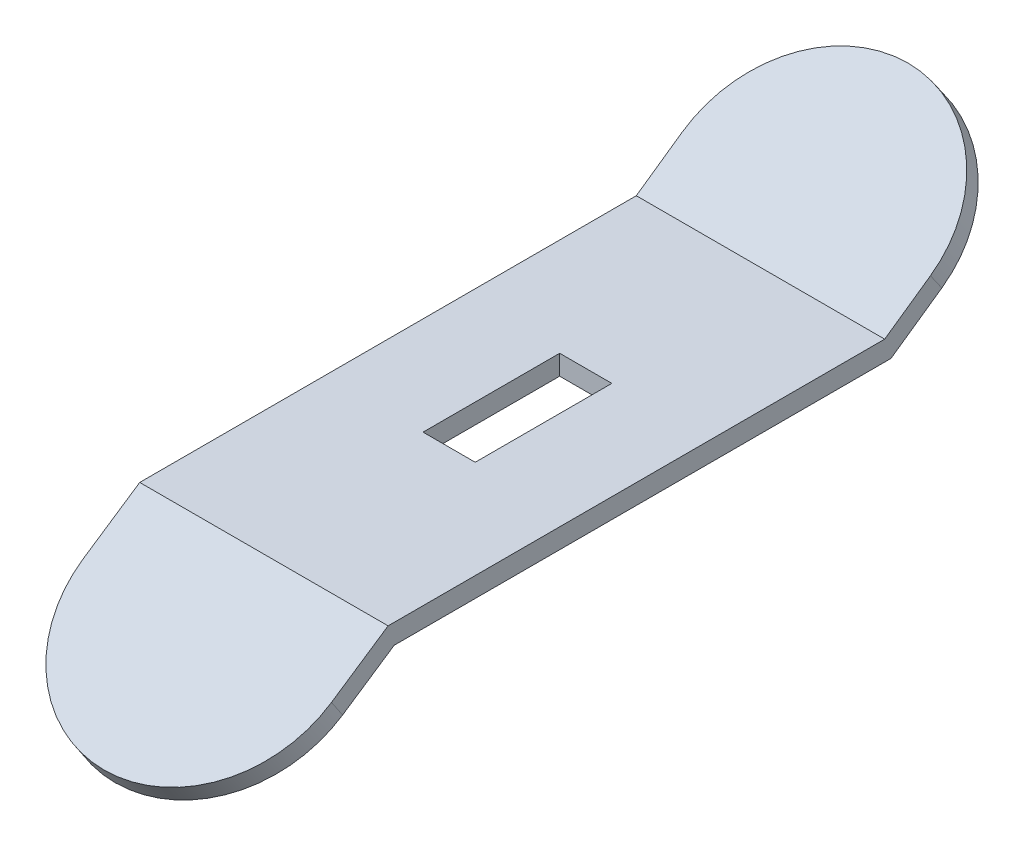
ISO-10303-21;
HEADER;
FILE_DESCRIPTION(('STEP AP214'),'2;1');
FILE_NAME('part.step','',(''),(''),'','','');
FILE_SCHEMA(('AUTOMOTIVE_DESIGN { 1 0 10303 214 1 1 1 1 }'));
ENDSEC;
DATA;
#1=APPLICATION_CONTEXT('core data for automotive mechanical design processes');
#2=APPLICATION_PROTOCOL_DEFINITION('international standard','automotive_design',2000,#1);
#3=PRODUCT_CONTEXT('',#1,'mechanical');
#4=PRODUCT('Part','Part','',(#3));
#5=PRODUCT_RELATED_PRODUCT_CATEGORY('part','',(#4));
#6=PRODUCT_DEFINITION_FORMATION('','',#4);
#7=PRODUCT_DEFINITION_CONTEXT('part definition',#1,'design');
#8=PRODUCT_DEFINITION('design','',#6,#7);
#9=PRODUCT_DEFINITION_SHAPE('','',#8);
#10=(LENGTH_UNIT() NAMED_UNIT(*) SI_UNIT(.MILLI.,.METRE.));
#11=(NAMED_UNIT(*) PLANE_ANGLE_UNIT() SI_UNIT($,.RADIAN.));
#12=(NAMED_UNIT(*) SI_UNIT($,.STERADIAN.) SOLID_ANGLE_UNIT());
#13=UNCERTAINTY_MEASURE_WITH_UNIT(LENGTH_MEASURE(1.E-05),#10,'distance_accuracy_value','');
#14=(GEOMETRIC_REPRESENTATION_CONTEXT(3) GLOBAL_UNCERTAINTY_ASSIGNED_CONTEXT((#13)) GLOBAL_UNIT_ASSIGNED_CONTEXT((#10,
#11,#12)) REPRESENTATION_CONTEXT('',''));
#15=CARTESIAN_POINT('',(0.,0.,0.));
#16=DIRECTION('',(0.,0.,1.));
#17=DIRECTION('',(1.,0.,0.));
#18=AXIS2_PLACEMENT_3D('',#15,#16,#17);
#19=CARTESIAN_POINT('',(0.,4.17852545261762,-23.2511802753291));
#20=DIRECTION('',(0.,-0.819152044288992,-0.573576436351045));
#21=DIRECTION('',(0.,0.573576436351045,-0.819152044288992));
#22=AXIS2_PLACEMENT_3D('',#19,#20,#21);
#23=CYLINDRICAL_SURFACE('',#22,10.);
#24=DIRECTION('',(0.,-0.819152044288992,-0.573576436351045));
#25=VECTOR('',#24,1.);
#26=CARTESIAN_POINT('',(-10.,12.2991740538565,-17.5650409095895));
#27=LINE('',#26,#25);
#28=CARTESIAN_POINT('',(-10.,4.17852545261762,-23.2511802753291));
#29=VERTEX_POINT('',#28);
#30=CARTESIAN_POINT('',(-10.,2.86788218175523,-24.1689025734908));
#31=VERTEX_POINT('',#30);
#32=EDGE_CURVE('E209',#29,#31,#27,.T.);
#33=ORIENTED_EDGE('',*,*,#32,.F.);
#34=CARTESIAN_POINT('',(0.,4.17852545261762,-23.2511802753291));
#35=DIRECTION('',(0.,-0.819152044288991,-0.573576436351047));
#36=DIRECTION('',(0.,0.573576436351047,-0.819152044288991));
#37=AXIS2_PLACEMENT_3D('',#34,#35,#36);
#38=CIRCLE('',#37,10.);
#39=CARTESIAN_POINT('',(10.,4.17852545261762,-23.2511802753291));
#40=VERTEX_POINT('',#39);
#41=EDGE_CURVE('E43',#40,#29,#38,.F.);
#42=ORIENTED_EDGE('',*,*,#41,.F.);
#43=DIRECTION('',(0.,0.819152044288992,0.573576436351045));
#44=VECTOR('',#43,1.);
#45=CARTESIAN_POINT('',(10.,4.17852545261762,-23.2511802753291));
#46=LINE('',#45,#44);
#47=CARTESIAN_POINT('',(10.,2.86788218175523,-24.1689025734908));
#48=VERTEX_POINT('',#47);
#49=EDGE_CURVE('E212',#48,#40,#46,.T.);
#50=ORIENTED_EDGE('',*,*,#49,.F.);
#51=CARTESIAN_POINT('',(0.,2.86788218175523,-24.1689025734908));
#52=DIRECTION('',(0.,-0.819152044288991,-0.573576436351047));
#53=DIRECTION('',(0.,0.573576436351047,-0.819152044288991));
#54=AXIS2_PLACEMENT_3D('',#51,#52,#53);
#55=CIRCLE('',#54,10.);
#56=EDGE_CURVE('E11',#31,#48,#55,.T.);
#57=ORIENTED_EDGE('',*,*,#56,.F.);
#58=EDGE_LOOP('',(#33,#42,#50,#57));
#59=FACE_BOUND('',#58,.T.);
#60=ADVANCED_FACE('F35',(#59),#23,.T.);
#61=CARTESIAN_POINT('',(0.,-1.45639389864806,24.9705583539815));
#62=DIRECTION('',(0.,0.830488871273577,0.557035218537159));
#63=DIRECTION('',(0.,-0.557035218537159,0.830488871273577));
#64=AXIS2_PLACEMENT_3D('',#61,#62,#63);
#65=CYLINDRICAL_SURFACE('',#64,10.);
#66=DIRECTION('',(0.,-0.830488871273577,-0.557035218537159));
#67=VECTOR('',#66,1.);
#68=CARTESIAN_POINT('',(10.,-1.45639389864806,24.9705583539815));
#69=LINE('',#68,#67);
#70=CARTESIAN_POINT('',(10.,-1.45639389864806,24.9705583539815));
#71=VERTEX_POINT('',#70);
#72=CARTESIAN_POINT('',(10.,-2.78517609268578,24.0793020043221));
#73=VERTEX_POINT('',#72);
#74=EDGE_CURVE('E199',#71,#73,#69,.T.);
#75=ORIENTED_EDGE('',*,*,#74,.F.);
#76=CARTESIAN_POINT('',(0.,-1.45639389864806,24.9705583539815));
#77=DIRECTION('',(0.,-0.830488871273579,-0.557035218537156));
#78=DIRECTION('',(0.,0.557035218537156,-0.830488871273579));
#79=AXIS2_PLACEMENT_3D('',#76,#77,#78);
#80=CIRCLE('',#79,10.);
#81=CARTESIAN_POINT('',(-10.,-1.45639389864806,24.9705583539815));
#82=VERTEX_POINT('',#81);
#83=EDGE_CURVE('E205',#82,#71,#80,.F.);
#84=ORIENTED_EDGE('',*,*,#83,.F.);
#85=DIRECTION('',(0.,0.830488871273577,0.557035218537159));
#86=VECTOR('',#85,1.);
#87=CARTESIAN_POINT('',(-10.,-12.0035705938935,17.8962325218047));
#88=LINE('',#87,#86);
#89=CARTESIAN_POINT('',(-10.,-2.78517609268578,24.0793020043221));
#90=VERTEX_POINT('',#89);
#91=EDGE_CURVE('E202',#90,#82,#88,.T.);
#92=ORIENTED_EDGE('',*,*,#91,.F.);
#93=CARTESIAN_POINT('',(0.,-2.78517609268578,24.0793020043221));
#94=DIRECTION('',(0.,-0.830488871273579,-0.557035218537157));
#95=DIRECTION('',(0.,0.557035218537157,-0.830488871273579));
#96=AXIS2_PLACEMENT_3D('',#93,#94,#95);
#97=CIRCLE('',#96,10.);
#98=EDGE_CURVE('E207',#73,#90,#97,.T.);
#99=ORIENTED_EDGE('',*,*,#98,.F.);
#100=EDGE_LOOP('',(#75,#84,#92,#99));
#101=FACE_BOUND('',#100,.T.);
#102=ADVANCED_FACE('F247',(#101),#65,.T.);
#103=CARTESIAN_POINT('',(10.,1.32878219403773,20.8181139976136));
#104=DIRECTION('',(0.,-0.830488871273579,-0.557035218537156));
#105=DIRECTION('',(0.,0.557035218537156,-0.830488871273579));
#106=AXIS2_PLACEMENT_3D('',#103,#104,#105);
#107=PLANE('',#106);
#108=DIRECTION('',(0.,-0.557035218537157,0.830488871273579));
#109=VECTOR('',#108,1.);
#110=CARTESIAN_POINT('',(-10.,1.32878219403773,20.8181139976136));
#111=LINE('',#110,#109);
#112=CARTESIAN_POINT('',(-10.,1.6,20.413752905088));
#113=VERTEX_POINT('',#112);
#114=EDGE_CURVE('E158',#113,#82,#111,.T.);
#115=ORIENTED_EDGE('',*,*,#114,.T.);
#116=ORIENTED_EDGE('',*,*,#83,.T.);
#117=DIRECTION('',(0.,-0.557035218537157,0.830488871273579));
#118=VECTOR('',#117,1.);
#119=CARTESIAN_POINT('',(10.,1.32878219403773,20.8181139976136));
#120=LINE('',#119,#118);
#121=CARTESIAN_POINT('',(10.,1.6,20.413752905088));
#122=VERTEX_POINT('',#121);
#123=EDGE_CURVE('E159',#122,#71,#120,.T.);
#124=ORIENTED_EDGE('',*,*,#123,.F.);
#125=DIRECTION('',(-1.,0.,0.));
#126=VECTOR('',#125,1.);
#127=CARTESIAN_POINT('',(10.,1.6,20.413752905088));
#128=LINE('',#127,#126);
#129=EDGE_CURVE('E175',#122,#113,#128,.T.);
#130=ORIENTED_EDGE('',*,*,#129,.T.);
#131=EDGE_LOOP('',(#115,#116,#124,#130));
#132=FACE_BOUND('',#131,.T.);
#133=ADVANCED_FACE('F249',(#132),#107,.F.);
#134=CARTESIAN_POINT('',(10.,0.,19.9268576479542));
#135=DIRECTION('',(0.,-0.830488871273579,-0.557035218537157));
#136=DIRECTION('',(0.,0.557035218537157,-0.830488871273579));
#137=AXIS2_PLACEMENT_3D('',#134,#135,#136);
#138=PLANE('',#137);
#139=DIRECTION('',(0.,-0.557035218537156,0.830488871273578));
#140=VECTOR('',#139,1.);
#141=CARTESIAN_POINT('',(10.,0.,19.9268576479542));
#142=LINE('',#141,#140);
#143=CARTESIAN_POINT('',(10.,0.,19.9268576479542));
#144=VERTEX_POINT('',#143);
#145=EDGE_CURVE('E162',#144,#73,#142,.T.);
#146=ORIENTED_EDGE('',*,*,#145,.T.);
#147=ORIENTED_EDGE('',*,*,#98,.T.);
#148=DIRECTION('',(0.,-0.557035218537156,0.830488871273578));
#149=VECTOR('',#148,1.);
#150=CARTESIAN_POINT('',(-10.,0.,19.9268576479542));
#151=LINE('',#150,#149);
#152=CARTESIAN_POINT('',(-10.,0.,19.9268576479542));
#153=VERTEX_POINT('',#152);
#154=EDGE_CURVE('E178',#153,#90,#151,.T.);
#155=ORIENTED_EDGE('',*,*,#154,.F.);
#156=DIRECTION('',(-1.,0.,0.));
#157=VECTOR('',#156,1.);
#158=CARTESIAN_POINT('',(10.,0.,19.9268576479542));
#159=LINE('',#158,#157);
#160=EDGE_CURVE('E196',#144,#153,#159,.T.);
#161=ORIENTED_EDGE('',*,*,#160,.F.);
#162=EDGE_LOOP('',(#146,#147,#155,#161));
#163=FACE_BOUND('',#162,.T.);
#164=ADVANCED_FACE('F243',(#163),#138,.T.);
#165=CARTESIAN_POINT('',(10.,0.,0.));
#166=DIRECTION('',(0.,-1.,0.));
#167=DIRECTION('',(0.,0.,-1.));
#168=AXIS2_PLACEMENT_3D('',#165,#166,#167);
#169=PLANE('',#168);
#170=DIRECTION('',(0.,0.,1.));
#171=VECTOR('',#170,1.);
#172=CARTESIAN_POINT('',(2.1,0.,0.));
#173=LINE('',#172,#171);
#174=CARTESIAN_POINT('',(2.1,0.,-5.5));
#175=VERTEX_POINT('',#174);
#176=CARTESIAN_POINT('',(2.1,0.,5.5));
#177=VERTEX_POINT('',#176);
#178=EDGE_CURVE('E156',#175,#177,#173,.T.);
#179=ORIENTED_EDGE('',*,*,#178,.F.);
#180=DIRECTION('',(1.,0.,0.));
#181=VECTOR('',#180,1.);
#182=CARTESIAN_POINT('',(10.,0.,-5.5));
#183=LINE('',#182,#181);
#184=CARTESIAN_POINT('',(-2.1,0.,-5.5));
#185=VERTEX_POINT('',#184);
#186=EDGE_CURVE('E149',#185,#175,#183,.T.);
#187=ORIENTED_EDGE('',*,*,#186,.F.);
#188=DIRECTION('',(0.,0.,-1.));
#189=VECTOR('',#188,1.);
#190=CARTESIAN_POINT('',(-2.1,0.,0.));
#191=LINE('',#190,#189);
#192=CARTESIAN_POINT('',(-2.1,0.,5.5));
#193=VERTEX_POINT('',#192);
#194=EDGE_CURVE('E129',#193,#185,#191,.T.);
#195=ORIENTED_EDGE('',*,*,#194,.F.);
#196=DIRECTION('',(-1.,0.,0.));
#197=VECTOR('',#196,1.);
#198=CARTESIAN_POINT('',(10.,0.,5.5));
#199=LINE('',#198,#197);
#200=EDGE_CURVE('E154',#177,#193,#199,.T.);
#201=ORIENTED_EDGE('',*,*,#200,.F.);
#202=EDGE_LOOP('',(#179,#187,#195,#201));
#203=FACE_BOUND('',#202,.T.);
#204=DIRECTION('',(0.,0.,1.));
#205=VECTOR('',#204,1.);
#206=CARTESIAN_POINT('',(-10.,0.,0.));
#207=LINE('',#206,#205);
#208=CARTESIAN_POINT('',(-10.,0.,-20.0731423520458));
#209=VERTEX_POINT('',#208);
#210=EDGE_CURVE('E181',#209,#153,#207,.T.);
#211=ORIENTED_EDGE('',*,*,#210,.F.);
#212=DIRECTION('',(-1.,0.,0.));
#213=VECTOR('',#212,1.);
#214=CARTESIAN_POINT('',(10.,0.,-20.0731423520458));
#215=LINE('',#214,#213);
#216=CARTESIAN_POINT('',(10.,0.,-20.0731423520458));
#217=VERTEX_POINT('',#216);
#218=EDGE_CURVE('E193',#217,#209,#215,.T.);
#219=ORIENTED_EDGE('',*,*,#218,.F.);
#220=DIRECTION('',(0.,0.,1.));
#221=VECTOR('',#220,1.);
#222=CARTESIAN_POINT('',(10.,0.,0.));
#223=LINE('',#222,#221);
#224=EDGE_CURVE('E166',#217,#144,#223,.T.);
#225=ORIENTED_EDGE('',*,*,#224,.T.);
#226=ORIENTED_EDGE('',*,*,#160,.T.);
#227=EDGE_LOOP('',(#211,#219,#225,#226));
#228=FACE_BOUND('',#227,.T.);
#229=ADVANCED_FACE('F241',(#203,#228),#169,.T.);
#230=CARTESIAN_POINT('',(10.,0.,-20.0731423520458));
#231=DIRECTION('',(0.,-0.819152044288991,-0.573576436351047));
#232=DIRECTION('',(0.,0.573576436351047,-0.819152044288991));
#233=AXIS2_PLACEMENT_3D('',#230,#231,#232);
#234=PLANE('',#233);
#235=DIRECTION('',(0.,-0.573576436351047,0.819152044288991));
#236=VECTOR('',#235,1.);
#237=CARTESIAN_POINT('',(-10.,0.,-20.0731423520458));
#238=LINE('',#237,#236);
#239=EDGE_CURVE('E183',#31,#209,#238,.T.);
#240=ORIENTED_EDGE('',*,*,#239,.F.);
#241=ORIENTED_EDGE('',*,*,#56,.T.);
#242=DIRECTION('',(0.,-0.573576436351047,0.819152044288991));
#243=VECTOR('',#242,1.);
#244=CARTESIAN_POINT('',(10.,0.,-20.0731423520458));
#245=LINE('',#244,#243);
#246=EDGE_CURVE('E169',#48,#217,#245,.T.);
#247=ORIENTED_EDGE('',*,*,#246,.T.);
#248=ORIENTED_EDGE('',*,*,#218,.T.);
#249=EDGE_LOOP('',(#240,#241,#247,#248));
#250=FACE_BOUND('',#249,.T.);
#251=ADVANCED_FACE('F237',(#250),#234,.T.);
#252=CARTESIAN_POINT('',(10.,1.31064327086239,-19.1554200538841));
#253=DIRECTION('',(0.,-0.819152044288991,-0.573576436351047));
#254=DIRECTION('',(0.,0.573576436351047,-0.819152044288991));
#255=AXIS2_PLACEMENT_3D('',#252,#253,#254);
#256=PLANE('',#255);
#257=DIRECTION('',(0.,-0.573576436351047,0.819152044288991));
#258=VECTOR('',#257,1.);
#259=CARTESIAN_POINT('',(10.,1.31064327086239,-19.1554200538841));
#260=LINE('',#259,#258);
#261=CARTESIAN_POINT('',(10.,1.6,-19.5686642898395));
#262=VERTEX_POINT('',#261);
#263=EDGE_CURVE('E171',#40,#262,#260,.T.);
#264=ORIENTED_EDGE('',*,*,#263,.F.);
#265=ORIENTED_EDGE('',*,*,#41,.T.);
#266=DIRECTION('',(0.,-0.573576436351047,0.819152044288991));
#267=VECTOR('',#266,1.);
#268=CARTESIAN_POINT('',(-10.,1.31064327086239,-19.1554200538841));
#269=LINE('',#268,#267);
#270=CARTESIAN_POINT('',(-10.,1.6,-19.5686642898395));
#271=VERTEX_POINT('',#270);
#272=EDGE_CURVE('E185',#29,#271,#269,.T.);
#273=ORIENTED_EDGE('',*,*,#272,.T.);
#274=DIRECTION('',(-1.,0.,0.));
#275=VECTOR('',#274,1.);
#276=CARTESIAN_POINT('',(10.,1.6,-19.5686642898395));
#277=LINE('',#276,#275);
#278=EDGE_CURVE('E190',#262,#271,#277,.T.);
#279=ORIENTED_EDGE('',*,*,#278,.F.);
#280=EDGE_LOOP('',(#264,#265,#273,#279));
#281=FACE_BOUND('',#280,.T.);
#282=ADVANCED_FACE('F217',(#281),#256,.F.);
#283=CARTESIAN_POINT('',(10.,1.6,0.));
#284=DIRECTION('',(0.,-1.,0.));
#285=DIRECTION('',(0.,0.,-1.));
#286=AXIS2_PLACEMENT_3D('',#283,#284,#285);
#287=PLANE('',#286);
#288=DIRECTION('',(-1.,0.,0.));
#289=VECTOR('',#288,1.);
#290=CARTESIAN_POINT('',(-2.1,1.6,-5.5));
#291=LINE('',#290,#289);
#292=CARTESIAN_POINT('',(2.1,1.6,-5.5));
#293=VERTEX_POINT('',#292);
#294=CARTESIAN_POINT('',(-2.1,1.6,-5.5));
#295=VERTEX_POINT('',#294);
#296=EDGE_CURVE('E135',#293,#295,#291,.T.);
#297=ORIENTED_EDGE('',*,*,#296,.F.);
#298=DIRECTION('',(0.,0.,-1.));
#299=VECTOR('',#298,1.);
#300=CARTESIAN_POINT('',(2.1,1.6,5.5));
#301=LINE('',#300,#299);
#302=CARTESIAN_POINT('',(2.1,1.6,5.5));
#303=VERTEX_POINT('',#302);
#304=EDGE_CURVE('E58',#303,#293,#301,.T.);
#305=ORIENTED_EDGE('',*,*,#304,.F.);
#306=DIRECTION('',(1.,0.,0.));
#307=VECTOR('',#306,1.);
#308=CARTESIAN_POINT('',(-2.1,1.6,5.5));
#309=LINE('',#308,#307);
#310=CARTESIAN_POINT('',(-2.1,1.6,5.5));
#311=VERTEX_POINT('',#310);
#312=EDGE_CURVE('E142',#311,#303,#309,.T.);
#313=ORIENTED_EDGE('',*,*,#312,.F.);
#314=DIRECTION('',(0.,0.,1.));
#315=VECTOR('',#314,1.);
#316=CARTESIAN_POINT('',(-2.1,1.6,5.5));
#317=LINE('',#316,#315);
#318=EDGE_CURVE('E126',#295,#311,#317,.T.);
#319=ORIENTED_EDGE('',*,*,#318,.F.);
#320=EDGE_LOOP('',(#297,#305,#313,#319));
#321=FACE_BOUND('',#320,.T.);
#322=DIRECTION('',(0.,0.,-1.));
#323=VECTOR('',#322,1.);
#324=CARTESIAN_POINT('',(-10.,1.6,0.));
#325=LINE('',#324,#323);
#326=EDGE_CURVE('E163',#271,#113,#325,.F.);
#327=ORIENTED_EDGE('',*,*,#326,.T.);
#328=ORIENTED_EDGE('',*,*,#129,.F.);
#329=DIRECTION('',(0.,0.,-1.));
#330=VECTOR('',#329,1.);
#331=CARTESIAN_POINT('',(10.,1.6,0.));
#332=LINE('',#331,#330);
#333=EDGE_CURVE('E173',#262,#122,#332,.F.);
#334=ORIENTED_EDGE('',*,*,#333,.F.);
#335=ORIENTED_EDGE('',*,*,#278,.T.);
#336=EDGE_LOOP('',(#327,#328,#334,#335));
#337=FACE_BOUND('',#336,.T.);
#338=ADVANCED_FACE('F139',(#321,#337),#287,.F.);
#339=CARTESIAN_POINT('',(10.,0.,0.));
#340=DIRECTION('',(-1.,0.,0.));
#341=DIRECTION('',(0.,0.,1.));
#342=AXIS2_PLACEMENT_3D('',#339,#340,#341);
#343=PLANE('',#342);
#344=ORIENTED_EDGE('',*,*,#246,.F.);
#345=ORIENTED_EDGE('',*,*,#49,.T.);
#346=ORIENTED_EDGE('',*,*,#263,.T.);
#347=ORIENTED_EDGE('',*,*,#333,.T.);
#348=ORIENTED_EDGE('',*,*,#123,.T.);
#349=ORIENTED_EDGE('',*,*,#74,.T.);
#350=ORIENTED_EDGE('',*,*,#145,.F.);
#351=ORIENTED_EDGE('',*,*,#224,.F.);
#352=EDGE_LOOP('',(#344,#345,#346,#347,#348,#349,#350,#351));
#353=FACE_BOUND('',#352,.T.);
#354=ADVANCED_FACE('F232',(#353),#343,.F.);
#355=CARTESIAN_POINT('',(-10.,0.,0.));
#356=DIRECTION('',(-1.,0.,0.));
#357=DIRECTION('',(0.,0.,1.));
#358=AXIS2_PLACEMENT_3D('',#355,#356,#357);
#359=PLANE('',#358);
#360=ORIENTED_EDGE('',*,*,#272,.F.);
#361=ORIENTED_EDGE('',*,*,#32,.T.);
#362=ORIENTED_EDGE('',*,*,#239,.T.);
#363=ORIENTED_EDGE('',*,*,#210,.T.);
#364=ORIENTED_EDGE('',*,*,#154,.T.);
#365=ORIENTED_EDGE('',*,*,#91,.T.);
#366=ORIENTED_EDGE('',*,*,#114,.F.);
#367=ORIENTED_EDGE('',*,*,#326,.F.);
#368=EDGE_LOOP('',(#360,#361,#362,#363,#364,#365,#366,#367));
#369=FACE_BOUND('',#368,.T.);
#370=ADVANCED_FACE('F225',(#369),#359,.T.);
#371=CARTESIAN_POINT('',(2.1,-8.35552827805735,5.5));
#372=DIRECTION('',(1.,0.,0.));
#373=DIRECTION('',(0.,0.,-1.));
#374=AXIS2_PLACEMENT_3D('',#371,#372,#373);
#375=PLANE('',#374);
#376=ORIENTED_EDGE('',*,*,#178,.T.);
#377=DIRECTION('',(0.,1.,0.));
#378=VECTOR('',#377,1.);
#379=CARTESIAN_POINT('',(2.1,-8.35552827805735,5.5));
#380=LINE('',#379,#378);
#381=EDGE_CURVE('E147',#177,#303,#380,.T.);
#382=ORIENTED_EDGE('',*,*,#381,.T.);
#383=ORIENTED_EDGE('',*,*,#304,.T.);
#384=DIRECTION('',(0.,1.,0.));
#385=VECTOR('',#384,1.);
#386=CARTESIAN_POINT('',(2.1,-8.35552827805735,-5.5));
#387=LINE('',#386,#385);
#388=EDGE_CURVE('E132',#175,#293,#387,.T.);
#389=ORIENTED_EDGE('',*,*,#388,.F.);
#390=EDGE_LOOP('',(#376,#382,#383,#389));
#391=FACE_BOUND('',#390,.T.);
#392=ADVANCED_FACE('F316',(#391),#375,.F.);
#393=CARTESIAN_POINT('',(-2.1,-8.35552827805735,5.5));
#394=DIRECTION('',(0.,0.,1.));
#395=DIRECTION('',(1.,0.,0.));
#396=AXIS2_PLACEMENT_3D('',#393,#394,#395);
#397=PLANE('',#396);
#398=ORIENTED_EDGE('',*,*,#200,.T.);
#399=DIRECTION('',(0.,1.,0.));
#400=VECTOR('',#399,1.);
#401=CARTESIAN_POINT('',(-2.1,-8.35552827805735,5.5));
#402=LINE('',#401,#400);
#403=EDGE_CURVE('E131',#193,#311,#402,.T.);
#404=ORIENTED_EDGE('',*,*,#403,.T.);
#405=ORIENTED_EDGE('',*,*,#312,.T.);
#406=ORIENTED_EDGE('',*,*,#381,.F.);
#407=EDGE_LOOP('',(#398,#404,#405,#406));
#408=FACE_BOUND('',#407,.T.);
#409=ADVANCED_FACE('F321',(#408),#397,.F.);
#410=CARTESIAN_POINT('',(-2.1,-8.35552827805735,5.5));
#411=DIRECTION('',(-1.,0.,0.));
#412=DIRECTION('',(0.,0.,1.));
#413=AXIS2_PLACEMENT_3D('',#410,#411,#412);
#414=PLANE('',#413);
#415=ORIENTED_EDGE('',*,*,#194,.T.);
#416=DIRECTION('',(0.,1.,0.));
#417=VECTOR('',#416,1.);
#418=CARTESIAN_POINT('',(-2.1,-8.35552827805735,-5.5));
#419=LINE('',#418,#417);
#420=EDGE_CURVE('E50',#185,#295,#419,.T.);
#421=ORIENTED_EDGE('',*,*,#420,.T.);
#422=ORIENTED_EDGE('',*,*,#318,.T.);
#423=ORIENTED_EDGE('',*,*,#403,.F.);
#424=EDGE_LOOP('',(#415,#421,#422,#423));
#425=FACE_BOUND('',#424,.T.);
#426=ADVANCED_FACE('F123',(#425),#414,.F.);
#427=CARTESIAN_POINT('',(-2.1,-8.35552827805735,-5.5));
#428=DIRECTION('',(0.,0.,-1.));
#429=DIRECTION('',(-1.,0.,0.));
#430=AXIS2_PLACEMENT_3D('',#427,#428,#429);
#431=PLANE('',#430);
#432=ORIENTED_EDGE('',*,*,#186,.T.);
#433=ORIENTED_EDGE('',*,*,#388,.T.);
#434=ORIENTED_EDGE('',*,*,#296,.T.);
#435=ORIENTED_EDGE('',*,*,#420,.F.);
#436=EDGE_LOOP('',(#432,#433,#434,#435));
#437=FACE_BOUND('',#436,.T.);
#438=ADVANCED_FACE('F136',(#437),#431,.F.);
#439=CLOSED_SHELL('',(#60,#102,#133,#164,#229,#251,#282,#338,#354,#370,#392,#409,#426,#438));
#440=MANIFOLD_SOLID_BREP('B2',#439);
#441=ADVANCED_BREP_SHAPE_REPRESENTATION('',(#18,#440),#14);
#442=SHAPE_DEFINITION_REPRESENTATION(#9,#441);
ENDSEC;
END-ISO-10303-21;
